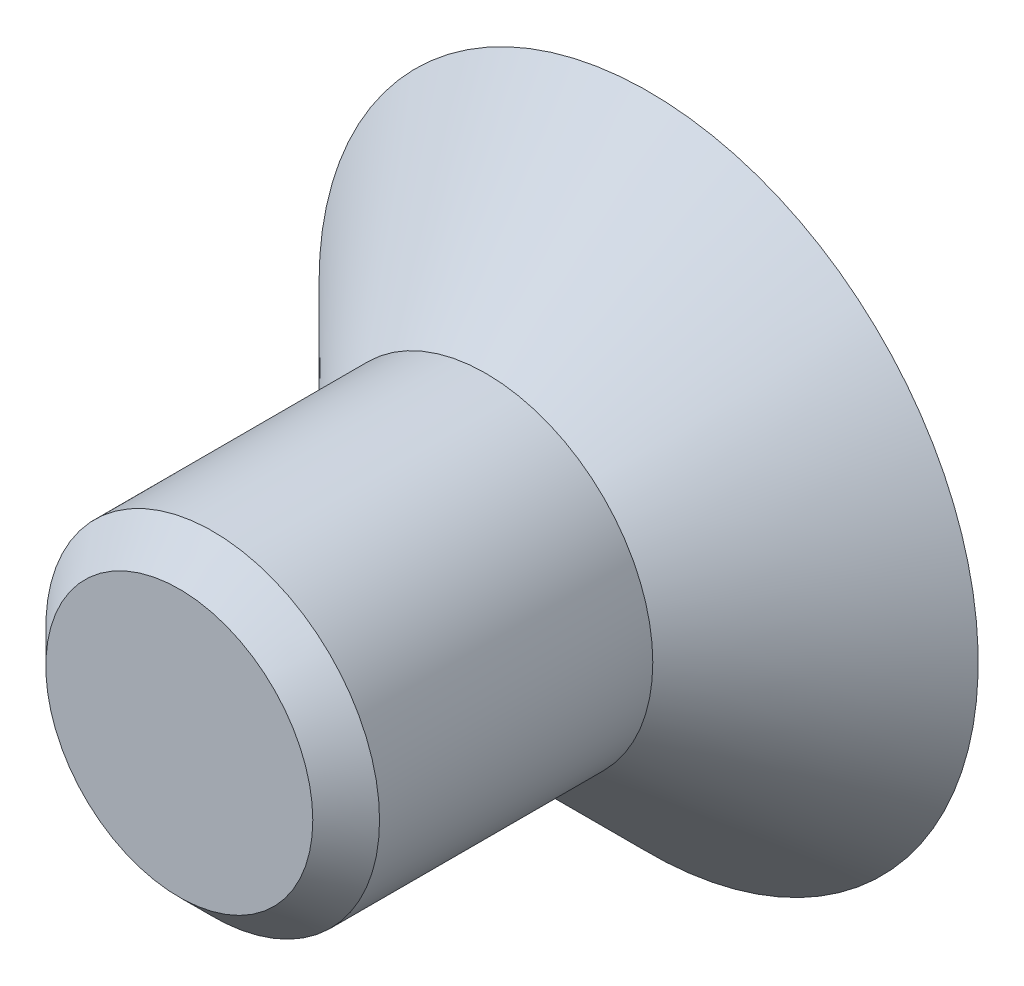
ISO-10303-21;
HEADER;
FILE_DESCRIPTION(('STEP AP214'),'2;1');
FILE_NAME('part.step','',(''),(''),'','','');
FILE_SCHEMA(('AUTOMOTIVE_DESIGN { 1 0 10303 214 1 1 1 1 }'));
ENDSEC;
DATA;
#1=APPLICATION_CONTEXT('core data for automotive mechanical design processes');
#2=APPLICATION_PROTOCOL_DEFINITION('international standard','automotive_design',2000,#1);
#3=PRODUCT_CONTEXT('',#1,'mechanical');
#4=PRODUCT('Part','Part','',(#3));
#5=PRODUCT_RELATED_PRODUCT_CATEGORY('part','',(#4));
#6=PRODUCT_DEFINITION_FORMATION('','',#4);
#7=PRODUCT_DEFINITION_CONTEXT('part definition',#1,'design');
#8=PRODUCT_DEFINITION('design','',#6,#7);
#9=PRODUCT_DEFINITION_SHAPE('','',#8);
#10=(LENGTH_UNIT() NAMED_UNIT(*) SI_UNIT(.MILLI.,.METRE.));
#11=(NAMED_UNIT(*) PLANE_ANGLE_UNIT() SI_UNIT($,.RADIAN.));
#12=(NAMED_UNIT(*) SI_UNIT($,.STERADIAN.) SOLID_ANGLE_UNIT());
#13=UNCERTAINTY_MEASURE_WITH_UNIT(LENGTH_MEASURE(1.E-05),#10,'distance_accuracy_value','');
#14=(GEOMETRIC_REPRESENTATION_CONTEXT(3) GLOBAL_UNCERTAINTY_ASSIGNED_CONTEXT((#13)) GLOBAL_UNIT_ASSIGNED_CONTEXT((#10,
#11,#12)) REPRESENTATION_CONTEXT('',''));
#15=CARTESIAN_POINT('',(0.,0.,0.));
#16=DIRECTION('',(0.,0.,1.));
#17=DIRECTION('',(1.,0.,0.));
#18=AXIS2_PLACEMENT_3D('',#15,#16,#17);
#19=CARTESIAN_POINT('',(0.,0.,-3.89999999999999));
#20=DIRECTION('',(0.,0.,1.));
#21=DIRECTION('',(1.,0.,0.));
#22=AXIS2_PLACEMENT_3D('',#19,#20,#21);
#23=PLANE('',#22);
#24=CARTESIAN_POINT('',(0.,0.,-3.89999999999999));
#25=DIRECTION('',(0.,0.,-1.));
#26=DIRECTION('',(-1.,0.,0.));
#27=AXIS2_PLACEMENT_3D('',#24,#25,#26);
#28=CIRCLE('',#27,7.9);
#29=CARTESIAN_POINT('',(-7.9,0.,-3.89999999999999));
#30=VERTEX_POINT('',#29);
#31=EDGE_CURVE('E97',#30,#30,#28,.T.);
#32=ORIENTED_EDGE('',*,*,#31,.T.);
#33=EDGE_LOOP('',(#32));
#34=FACE_BOUND('',#33,.T.);
#35=DIRECTION('',(-0.86602540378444,0.499999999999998,0.));
#36=VECTOR('',#35,1.);
#37=CARTESIAN_POINT('',(0.,2.88675134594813,-3.89999999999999));
#38=LINE('',#37,#36);
#39=CARTESIAN_POINT('',(2.5,1.44337567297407,-3.89999999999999));
#40=VERTEX_POINT('',#39);
#41=CARTESIAN_POINT('',(0.,2.88675134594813,-3.89999999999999));
#42=VERTEX_POINT('',#41);
#43=EDGE_CURVE('E43',#40,#42,#38,.T.);
#44=ORIENTED_EDGE('',*,*,#43,.T.);
#45=DIRECTION('',(-0.866025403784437,-0.500000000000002,0.));
#46=VECTOR('',#45,1.);
#47=CARTESIAN_POINT('',(-2.5,1.44337567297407,-3.89999999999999));
#48=LINE('',#47,#46);
#49=CARTESIAN_POINT('',(-2.5,1.44337567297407,-3.89999999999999));
#50=VERTEX_POINT('',#49);
#51=EDGE_CURVE('E83',#42,#50,#48,.T.);
#52=ORIENTED_EDGE('',*,*,#51,.T.);
#53=DIRECTION('',(0.,-1.,0.));
#54=VECTOR('',#53,1.);
#55=CARTESIAN_POINT('',(-2.5,-1.44337567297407,-3.89999999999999));
#56=LINE('',#55,#54);
#57=CARTESIAN_POINT('',(-2.5,-1.44337567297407,-3.89999999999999));
#58=VERTEX_POINT('',#57);
#59=EDGE_CURVE('E91',#50,#58,#56,.T.);
#60=ORIENTED_EDGE('',*,*,#59,.T.);
#61=DIRECTION('',(0.866025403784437,-0.500000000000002,0.));
#62=VECTOR('',#61,1.);
#63=CARTESIAN_POINT('',(-2.5,-1.44337567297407,-3.89999999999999));
#64=LINE('',#63,#62);
#65=CARTESIAN_POINT('',(0.,-2.88675134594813,-3.89999999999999));
#66=VERTEX_POINT('',#65);
#67=EDGE_CURVE('E109',#58,#66,#64,.T.);
#68=ORIENTED_EDGE('',*,*,#67,.T.);
#69=DIRECTION('',(0.86602540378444,0.499999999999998,0.));
#70=VECTOR('',#69,1.);
#71=CARTESIAN_POINT('',(0.,-2.88675134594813,-3.89999999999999));
#72=LINE('',#71,#70);
#73=CARTESIAN_POINT('',(2.5,-1.44337567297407,-3.89999999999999));
#74=VERTEX_POINT('',#73);
#75=EDGE_CURVE('E112',#66,#74,#72,.T.);
#76=ORIENTED_EDGE('',*,*,#75,.T.);
#77=DIRECTION('',(0.,1.,0.));
#78=VECTOR('',#77,1.);
#79=CARTESIAN_POINT('',(2.5,-1.44337567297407,-3.89999999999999));
#80=LINE('',#79,#78);
#81=EDGE_CURVE('E102',#74,#40,#80,.T.);
#82=ORIENTED_EDGE('',*,*,#81,.T.);
#83=EDGE_LOOP('',(#44,#52,#60,#68,#76,#82));
#84=FACE_BOUND('',#83,.T.);
#85=ADVANCED_FACE('F29',(#34,#84),#23,.F.);
#86=CARTESIAN_POINT('',(0.,0.,0.));
#87=DIRECTION('',(0.,0.,-1.));
#88=DIRECTION('',(-1.,0.,0.));
#89=AXIS2_PLACEMENT_3D('',#86,#87,#88);
#90=CONICAL_SURFACE('',#89,4.,0.78539816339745);
#91=ORIENTED_EDGE('',*,*,#31,.F.);
#92=EDGE_LOOP('',(#91));
#93=FACE_BOUND('',#92,.T.);
#94=CARTESIAN_POINT('',(0.,0.,0.));
#95=DIRECTION('',(0.,0.,1.));
#96=DIRECTION('',(1.,0.,0.));
#97=AXIS2_PLACEMENT_3D('',#94,#95,#96);
#98=CIRCLE('',#97,4.);
#99=CARTESIAN_POINT('',(4.,0.,0.));
#100=VERTEX_POINT('',#99);
#101=EDGE_CURVE('E103',#100,#100,#98,.T.);
#102=ORIENTED_EDGE('',*,*,#101,.F.);
#103=EDGE_LOOP('',(#102));
#104=FACE_BOUND('',#103,.T.);
#105=ADVANCED_FACE('F152',(#93,#104),#90,.T.);
#106=CARTESIAN_POINT('',(0.,2.88675134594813,-0.0999999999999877));
#107=DIRECTION('',(-0.499999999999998,-0.86602540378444,0.));
#108=DIRECTION('',(0.86602540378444,-0.499999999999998,0.));
#109=AXIS2_PLACEMENT_3D('',#106,#107,#108);
#110=PLANE('',#109);
#111=ORIENTED_EDGE('',*,*,#43,.F.);
#112=DIRECTION('',(0.,0.,-1.));
#113=VECTOR('',#112,1.);
#114=CARTESIAN_POINT('',(2.5,1.44337567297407,-0.0999999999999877));
#115=LINE('',#114,#113);
#116=CARTESIAN_POINT('',(2.5,1.44337567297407,-0.0999999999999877));
#117=VERTEX_POINT('',#116);
#118=EDGE_CURVE('E125',#117,#40,#115,.T.);
#119=ORIENTED_EDGE('',*,*,#118,.F.);
#120=DIRECTION('',(-0.86602540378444,0.499999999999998,0.));
#121=VECTOR('',#120,1.);
#122=CARTESIAN_POINT('',(0.,2.88675134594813,-0.0999999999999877));
#123=LINE('',#122,#121);
#124=CARTESIAN_POINT('',(0.,2.88675134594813,-0.0999999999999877));
#125=VERTEX_POINT('',#124);
#126=EDGE_CURVE('E96',#117,#125,#123,.T.);
#127=ORIENTED_EDGE('',*,*,#126,.T.);
#128=DIRECTION('',(0.,0.,-1.));
#129=VECTOR('',#128,1.);
#130=CARTESIAN_POINT('',(0.,2.88675134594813,-0.0999999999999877));
#131=LINE('',#130,#129);
#132=EDGE_CURVE('E85',#125,#42,#131,.T.);
#133=ORIENTED_EDGE('',*,*,#132,.T.);
#134=EDGE_LOOP('',(#111,#119,#127,#133));
#135=FACE_BOUND('',#134,.T.);
#136=ADVANCED_FACE('F94',(#135),#110,.T.);
#137=CARTESIAN_POINT('',(-2.5,1.44337567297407,-0.0999999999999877));
#138=DIRECTION('',(0.500000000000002,-0.866025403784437,0.));
#139=DIRECTION('',(0.866025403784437,0.500000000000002,0.));
#140=AXIS2_PLACEMENT_3D('',#137,#138,#139);
#141=PLANE('',#140);
#142=ORIENTED_EDGE('',*,*,#51,.F.);
#143=ORIENTED_EDGE('',*,*,#132,.F.);
#144=DIRECTION('',(-0.866025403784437,-0.500000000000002,0.));
#145=VECTOR('',#144,1.);
#146=CARTESIAN_POINT('',(-2.5,1.44337567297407,-0.0999999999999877));
#147=LINE('',#146,#145);
#148=CARTESIAN_POINT('',(-2.5,1.44337567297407,-0.0999999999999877));
#149=VERTEX_POINT('',#148);
#150=EDGE_CURVE('E116',#125,#149,#147,.T.);
#151=ORIENTED_EDGE('',*,*,#150,.T.);
#152=DIRECTION('',(0.,0.,-1.));
#153=VECTOR('',#152,1.);
#154=CARTESIAN_POINT('',(-2.5,1.44337567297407,-0.0999999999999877));
#155=LINE('',#154,#153);
#156=EDGE_CURVE('E87',#149,#50,#155,.T.);
#157=ORIENTED_EDGE('',*,*,#156,.T.);
#158=EDGE_LOOP('',(#142,#143,#151,#157));
#159=FACE_BOUND('',#158,.T.);
#160=ADVANCED_FACE('F84',(#159),#141,.T.);
#161=CARTESIAN_POINT('',(-2.5,-1.44337567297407,-0.0999999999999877));
#162=DIRECTION('',(1.,0.,0.));
#163=DIRECTION('',(0.,0.,-1.));
#164=AXIS2_PLACEMENT_3D('',#161,#162,#163);
#165=PLANE('',#164);
#166=ORIENTED_EDGE('',*,*,#59,.F.);
#167=ORIENTED_EDGE('',*,*,#156,.F.);
#168=DIRECTION('',(0.,-1.,0.));
#169=VECTOR('',#168,1.);
#170=CARTESIAN_POINT('',(-2.5,-1.44337567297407,-0.0999999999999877));
#171=LINE('',#170,#169);
#172=CARTESIAN_POINT('',(-2.5,-1.44337567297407,-0.0999999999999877));
#173=VERTEX_POINT('',#172);
#174=EDGE_CURVE('E118',#149,#173,#171,.T.);
#175=ORIENTED_EDGE('',*,*,#174,.T.);
#176=DIRECTION('',(0.,0.,-1.));
#177=VECTOR('',#176,1.);
#178=CARTESIAN_POINT('',(-2.5,-1.44337567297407,-0.0999999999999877));
#179=LINE('',#178,#177);
#180=EDGE_CURVE('E131',#173,#58,#179,.T.);
#181=ORIENTED_EDGE('',*,*,#180,.T.);
#182=EDGE_LOOP('',(#166,#167,#175,#181));
#183=FACE_BOUND('',#182,.T.);
#184=ADVANCED_FACE('F169',(#183),#165,.T.);
#185=CARTESIAN_POINT('',(-2.5,-1.44337567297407,-0.0999999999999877));
#186=DIRECTION('',(0.500000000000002,0.866025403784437,0.));
#187=DIRECTION('',(-0.866025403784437,0.500000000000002,0.));
#188=AXIS2_PLACEMENT_3D('',#185,#186,#187);
#189=PLANE('',#188);
#190=ORIENTED_EDGE('',*,*,#67,.F.);
#191=ORIENTED_EDGE('',*,*,#180,.F.);
#192=DIRECTION('',(0.866025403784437,-0.500000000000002,0.));
#193=VECTOR('',#192,1.);
#194=CARTESIAN_POINT('',(-2.5,-1.44337567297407,-0.0999999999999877));
#195=LINE('',#194,#193);
#196=CARTESIAN_POINT('',(0.,-2.88675134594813,-0.0999999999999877));
#197=VERTEX_POINT('',#196);
#198=EDGE_CURVE('E120',#173,#197,#195,.T.);
#199=ORIENTED_EDGE('',*,*,#198,.T.);
#200=DIRECTION('',(0.,0.,-1.));
#201=VECTOR('',#200,1.);
#202=CARTESIAN_POINT('',(0.,-2.88675134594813,-0.0999999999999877));
#203=LINE('',#202,#201);
#204=EDGE_CURVE('E129',#197,#66,#203,.T.);
#205=ORIENTED_EDGE('',*,*,#204,.T.);
#206=EDGE_LOOP('',(#190,#191,#199,#205));
#207=FACE_BOUND('',#206,.T.);
#208=ADVANCED_FACE('F172',(#207),#189,.T.);
#209=CARTESIAN_POINT('',(0.,-2.88675134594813,-0.0999999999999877));
#210=DIRECTION('',(-0.499999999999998,0.86602540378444,0.));
#211=DIRECTION('',(-0.86602540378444,-0.499999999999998,0.));
#212=AXIS2_PLACEMENT_3D('',#209,#210,#211);
#213=PLANE('',#212);
#214=ORIENTED_EDGE('',*,*,#75,.F.);
#215=ORIENTED_EDGE('',*,*,#204,.F.);
#216=DIRECTION('',(0.86602540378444,0.499999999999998,0.));
#217=VECTOR('',#216,1.);
#218=CARTESIAN_POINT('',(0.,-2.88675134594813,-0.0999999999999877));
#219=LINE('',#218,#217);
#220=CARTESIAN_POINT('',(2.5,-1.44337567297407,-0.0999999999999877));
#221=VERTEX_POINT('',#220);
#222=EDGE_CURVE('E122',#197,#221,#219,.T.);
#223=ORIENTED_EDGE('',*,*,#222,.T.);
#224=DIRECTION('',(0.,0.,-1.));
#225=VECTOR('',#224,1.);
#226=CARTESIAN_POINT('',(2.5,-1.44337567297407,-0.0999999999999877));
#227=LINE('',#226,#225);
#228=EDGE_CURVE('E127',#221,#74,#227,.T.);
#229=ORIENTED_EDGE('',*,*,#228,.T.);
#230=EDGE_LOOP('',(#214,#215,#223,#229));
#231=FACE_BOUND('',#230,.T.);
#232=ADVANCED_FACE('F176',(#231),#213,.T.);
#233=CARTESIAN_POINT('',(2.5,-1.44337567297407,-0.0999999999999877));
#234=DIRECTION('',(-1.,0.,0.));
#235=DIRECTION('',(0.,0.,1.));
#236=AXIS2_PLACEMENT_3D('',#233,#234,#235);
#237=PLANE('',#236);
#238=ORIENTED_EDGE('',*,*,#81,.F.);
#239=ORIENTED_EDGE('',*,*,#228,.F.);
#240=DIRECTION('',(0.,1.,0.));
#241=VECTOR('',#240,1.);
#242=CARTESIAN_POINT('',(2.5,-1.44337567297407,-0.0999999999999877));
#243=LINE('',#242,#241);
#244=EDGE_CURVE('E50',#221,#117,#243,.T.);
#245=ORIENTED_EDGE('',*,*,#244,.T.);
#246=ORIENTED_EDGE('',*,*,#118,.T.);
#247=EDGE_LOOP('',(#238,#239,#245,#246));
#248=FACE_BOUND('',#247,.T.);
#249=ADVANCED_FACE('F180',(#248),#237,.T.);
#250=CARTESIAN_POINT('',(2.5,1.44337567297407,-0.0999999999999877));
#251=DIRECTION('',(0.,0.,1.));
#252=DIRECTION('',(1.,0.,0.));
#253=AXIS2_PLACEMENT_3D('',#250,#251,#252);
#254=PLANE('',#253);
#255=ORIENTED_EDGE('',*,*,#126,.F.);
#256=ORIENTED_EDGE('',*,*,#244,.F.);
#257=ORIENTED_EDGE('',*,*,#222,.F.);
#258=ORIENTED_EDGE('',*,*,#198,.F.);
#259=ORIENTED_EDGE('',*,*,#174,.F.);
#260=ORIENTED_EDGE('',*,*,#150,.F.);
#261=EDGE_LOOP('',(#255,#256,#257,#258,#259,#260));
#262=FACE_BOUND('',#261,.T.);
#263=ADVANCED_FACE('F184',(#262),#254,.F.);
#264=CARTESIAN_POINT('',(0.,0.,7.35));
#265=DIRECTION('',(0.,0.,1.));
#266=DIRECTION('',(1.,0.,0.));
#267=AXIS2_PLACEMENT_3D('',#264,#265,#266);
#268=PLANE('',#267);
#269=CARTESIAN_POINT('',(0.,0.,7.35));
#270=DIRECTION('',(0.,0.,1.));
#271=DIRECTION('',(1.,0.,0.));
#272=AXIS2_PLACEMENT_3D('',#269,#270,#271);
#273=CIRCLE('',#272,3.2);
#274=CARTESIAN_POINT('',(3.2,0.,7.35));
#275=VERTEX_POINT('',#274);
#276=EDGE_CURVE('E36',#275,#275,#273,.T.);
#277=ORIENTED_EDGE('',*,*,#276,.T.);
#278=EDGE_LOOP('',(#277));
#279=FACE_BOUND('',#278,.T.);
#280=ADVANCED_FACE('F138',(#279),#268,.T.);
#281=CARTESIAN_POINT('',(0.,0.,0.));
#282=DIRECTION('',(0.,0.,1.));
#283=DIRECTION('',(1.,0.,0.));
#284=AXIS2_PLACEMENT_3D('',#281,#282,#283);
#285=CYLINDRICAL_SURFACE('',#284,4.);
#286=CARTESIAN_POINT('',(0.,0.,6.55));
#287=DIRECTION('',(0.,0.,1.));
#288=DIRECTION('',(1.,0.,0.));
#289=AXIS2_PLACEMENT_3D('',#286,#287,#288);
#290=CIRCLE('',#289,4.);
#291=CARTESIAN_POINT('',(4.,0.,6.55));
#292=VERTEX_POINT('',#291);
#293=EDGE_CURVE('E11',#292,#292,#290,.F.);
#294=ORIENTED_EDGE('',*,*,#293,.T.);
#295=EDGE_LOOP('',(#294));
#296=FACE_BOUND('',#295,.T.);
#297=ORIENTED_EDGE('',*,*,#101,.T.);
#298=EDGE_LOOP('',(#297));
#299=FACE_BOUND('',#298,.T.);
#300=ADVANCED_FACE('F142',(#296,#299),#285,.T.);
#301=CARTESIAN_POINT('',(0.,0.,7.35));
#302=DIRECTION('',(0.,0.,-1.));
#303=DIRECTION('',(-1.,0.,0.));
#304=AXIS2_PLACEMENT_3D('',#301,#302,#303);
#305=CONICAL_SURFACE('',#304,3.2,0.785398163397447);
#306=ORIENTED_EDGE('',*,*,#293,.F.);
#307=EDGE_LOOP('',(#306));
#308=FACE_BOUND('',#307,.T.);
#309=ORIENTED_EDGE('',*,*,#276,.F.);
#310=EDGE_LOOP('',(#309));
#311=FACE_BOUND('',#310,.T.);
#312=ADVANCED_FACE('F140',(#308,#311),#305,.T.);
#313=CLOSED_SHELL('',(#85,#105,#136,#160,#184,#208,#232,#249,#263,#280,#300,#312));
#314=MANIFOLD_SOLID_BREP('B2',#313);
#315=ADVANCED_BREP_SHAPE_REPRESENTATION('',(#18,#314),#14);
#316=SHAPE_DEFINITION_REPRESENTATION(#9,#315);
ENDSEC;
END-ISO-10303-21;
